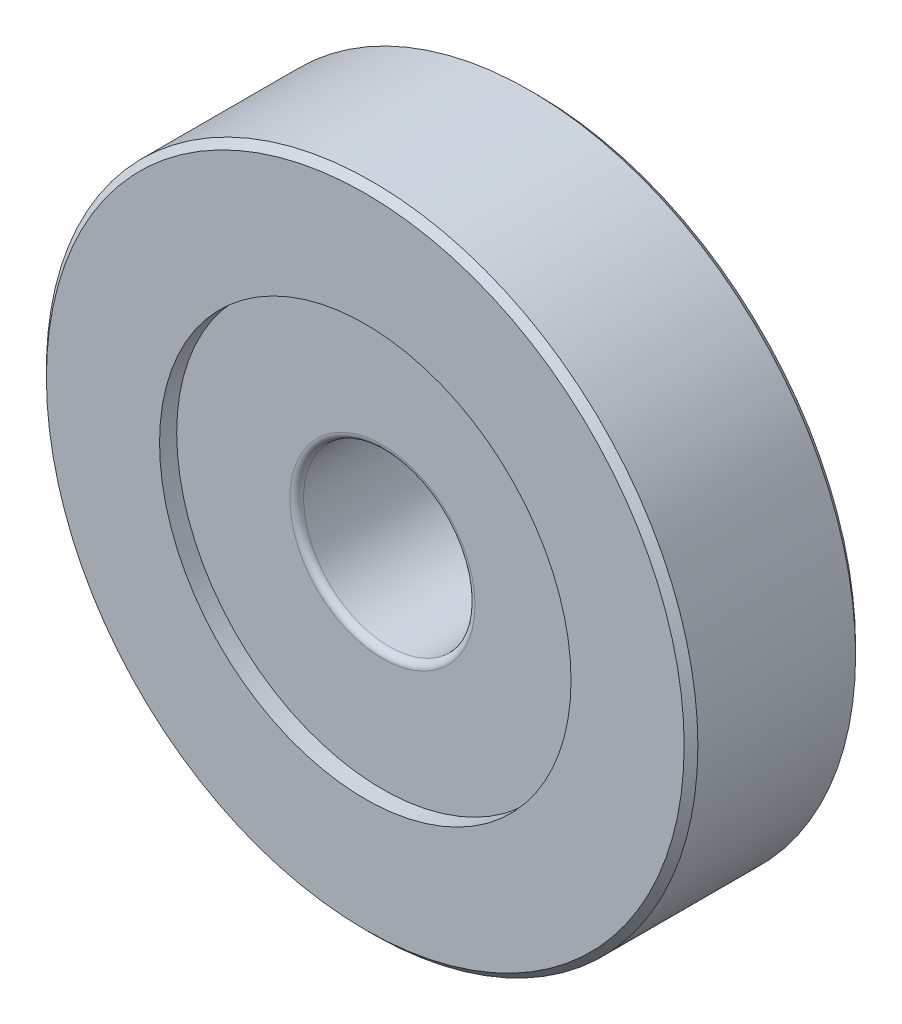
ISO-10303-21;
HEADER;
FILE_DESCRIPTION(('STEP AP214'),'2;1');
FILE_NAME('part.step','',(''),(''),'','','');
FILE_SCHEMA(('AUTOMOTIVE_DESIGN { 1 0 10303 214 1 1 1 1 }'));
ENDSEC;
DATA;
#1=APPLICATION_CONTEXT('core data for automotive mechanical design processes');
#2=APPLICATION_PROTOCOL_DEFINITION('international standard','automotive_design',2000,#1);
#3=PRODUCT_CONTEXT('',#1,'mechanical');
#4=PRODUCT('Part','Part','',(#3));
#5=PRODUCT_RELATED_PRODUCT_CATEGORY('part','',(#4));
#6=PRODUCT_DEFINITION_FORMATION('','',#4);
#7=PRODUCT_DEFINITION_CONTEXT('part definition',#1,'design');
#8=PRODUCT_DEFINITION('design','',#6,#7);
#9=PRODUCT_DEFINITION_SHAPE('','',#8);
#10=(LENGTH_UNIT() NAMED_UNIT(*) SI_UNIT(.MILLI.,.METRE.));
#11=(NAMED_UNIT(*) PLANE_ANGLE_UNIT() SI_UNIT($,.RADIAN.));
#12=(NAMED_UNIT(*) SI_UNIT($,.STERADIAN.) SOLID_ANGLE_UNIT());
#13=UNCERTAINTY_MEASURE_WITH_UNIT(LENGTH_MEASURE(1.E-05),#10,'distance_accuracy_value','');
#14=(GEOMETRIC_REPRESENTATION_CONTEXT(3) GLOBAL_UNCERTAINTY_ASSIGNED_CONTEXT((#13)) GLOBAL_UNIT_ASSIGNED_CONTEXT((#10,
#11,#12)) REPRESENTATION_CONTEXT('',''));
#15=CARTESIAN_POINT('',(0.,0.,0.));
#16=DIRECTION('',(0.,0.,1.));
#17=DIRECTION('',(1.,0.,0.));
#18=AXIS2_PLACEMENT_3D('',#15,#16,#17);
#19=CARTESIAN_POINT('',(0.,0.,1.80000000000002));
#20=DIRECTION('',(0.,0.,1.));
#21=DIRECTION('',(1.,0.,0.));
#22=AXIS2_PLACEMENT_3D('',#19,#20,#21);
#23=TOROIDAL_SURFACE('',#22,2.7,0.199999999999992);
#24=CARTESIAN_POINT('',(0.,0.,1.80000000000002));
#25=DIRECTION('',(0.,0.,1.));
#26=DIRECTION('',(1.,0.,0.));
#27=AXIS2_PLACEMENT_3D('',#24,#25,#26);
#28=CIRCLE('',#27,2.5);
#29=CARTESIAN_POINT('',(2.5,0.,1.80000000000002));
#30=VERTEX_POINT('',#29);
#31=EDGE_CURVE('E8',#30,#30,#28,.T.);
#32=ORIENTED_EDGE('',*,*,#31,.F.);
#33=EDGE_LOOP('',(#32));
#34=FACE_BOUND('',#33,.T.);
#35=CARTESIAN_POINT('',(0.,0.,2.));
#36=DIRECTION('',(0.,0.,1.));
#37=DIRECTION('',(1.,0.,0.));
#38=AXIS2_PLACEMENT_3D('',#35,#36,#37);
#39=CIRCLE('',#38,2.7);
#40=CARTESIAN_POINT('',(2.7,0.,2.));
#41=VERTEX_POINT('',#40);
#42=EDGE_CURVE('E52',#41,#41,#39,.T.);
#43=ORIENTED_EDGE('',*,*,#42,.T.);
#44=EDGE_LOOP('',(#43));
#45=FACE_BOUND('',#44,.T.);
#46=ADVANCED_FACE('F12',(#34,#45),#23,.T.);
#47=CARTESIAN_POINT('',(0.,0.,5.5));
#48=DIRECTION('',(0.,0.,1.));
#49=DIRECTION('',(1.,0.,0.));
#50=AXIS2_PLACEMENT_3D('',#47,#48,#49);
#51=CYLINDRICAL_SURFACE('',#50,2.5);
#52=CARTESIAN_POINT('',(0.,0.,-1.8));
#53=DIRECTION('',(0.,0.,1.));
#54=DIRECTION('',(1.,0.,0.));
#55=AXIS2_PLACEMENT_3D('',#52,#53,#54);
#56=CIRCLE('',#55,2.5);
#57=CARTESIAN_POINT('',(2.5,0.,-1.8));
#58=VERTEX_POINT('',#57);
#59=EDGE_CURVE('E18',#58,#58,#56,.T.);
#60=ORIENTED_EDGE('',*,*,#59,.F.);
#61=EDGE_LOOP('',(#60));
#62=FACE_BOUND('',#61,.T.);
#63=ORIENTED_EDGE('',*,*,#31,.T.);
#64=EDGE_LOOP('',(#63));
#65=FACE_BOUND('',#64,.T.);
#66=ADVANCED_FACE('F113',(#62,#65),#51,.F.);
#67=CARTESIAN_POINT('',(0.,0.,-1.8));
#68=DIRECTION('',(0.,0.,1.));
#69=DIRECTION('',(1.,0.,0.));
#70=AXIS2_PLACEMENT_3D('',#67,#68,#69);
#71=TOROIDAL_SURFACE('',#70,2.7,0.200000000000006);
#72=CARTESIAN_POINT('',(0.,0.,-2.));
#73=DIRECTION('',(0.,0.,1.));
#74=DIRECTION('',(1.,0.,0.));
#75=AXIS2_PLACEMENT_3D('',#72,#73,#74);
#76=CIRCLE('',#75,2.7);
#77=CARTESIAN_POINT('',(2.7,0.,-2.));
#78=VERTEX_POINT('',#77);
#79=EDGE_CURVE('E22',#78,#78,#76,.T.);
#80=ORIENTED_EDGE('',*,*,#79,.F.);
#81=EDGE_LOOP('',(#80));
#82=FACE_BOUND('',#81,.T.);
#83=ORIENTED_EDGE('',*,*,#59,.T.);
#84=EDGE_LOOP('',(#83));
#85=FACE_BOUND('',#84,.T.);
#86=ADVANCED_FACE('F108',(#82,#85),#71,.T.);
#87=CARTESIAN_POINT('',(0.,2.7,-2.));
#88=DIRECTION('',(0.,0.,1.));
#89=DIRECTION('',(1.,0.,0.));
#90=AXIS2_PLACEMENT_3D('',#87,#88,#89);
#91=PLANE('',#90);
#92=CARTESIAN_POINT('',(0.,0.,-2.));
#93=DIRECTION('',(0.,0.,1.));
#94=DIRECTION('',(1.,0.,0.));
#95=AXIS2_PLACEMENT_3D('',#92,#93,#94);
#96=CIRCLE('',#95,6.);
#97=CARTESIAN_POINT('',(6.,0.,-2.));
#98=VERTEX_POINT('',#97);
#99=EDGE_CURVE('E26',#98,#98,#96,.T.);
#100=ORIENTED_EDGE('',*,*,#99,.F.);
#101=EDGE_LOOP('',(#100));
#102=FACE_BOUND('',#101,.T.);
#103=ORIENTED_EDGE('',*,*,#79,.T.);
#104=EDGE_LOOP('',(#103));
#105=FACE_BOUND('',#104,.T.);
#106=ADVANCED_FACE('F102',(#102,#105),#91,.F.);
#107=CARTESIAN_POINT('',(0.,0.,5.5));
#108=DIRECTION('',(0.,0.,1.));
#109=DIRECTION('',(1.,0.,0.));
#110=AXIS2_PLACEMENT_3D('',#107,#108,#109);
#111=CYLINDRICAL_SURFACE('',#110,6.);
#112=CARTESIAN_POINT('',(0.,0.,-2.5));
#113=DIRECTION('',(0.,0.,1.));
#114=DIRECTION('',(1.,0.,0.));
#115=AXIS2_PLACEMENT_3D('',#112,#113,#114);
#116=CIRCLE('',#115,6.);
#117=CARTESIAN_POINT('',(6.,0.,-2.5));
#118=VERTEX_POINT('',#117);
#119=EDGE_CURVE('E31',#118,#118,#116,.T.);
#120=ORIENTED_EDGE('',*,*,#119,.F.);
#121=EDGE_LOOP('',(#120));
#122=FACE_BOUND('',#121,.T.);
#123=ORIENTED_EDGE('',*,*,#99,.T.);
#124=EDGE_LOOP('',(#123));
#125=FACE_BOUND('',#124,.T.);
#126=ADVANCED_FACE('F96',(#122,#125),#111,.F.);
#127=CARTESIAN_POINT('',(0.,9.3,-2.5));
#128=DIRECTION('',(0.,0.,1.));
#129=DIRECTION('',(1.,0.,0.));
#130=AXIS2_PLACEMENT_3D('',#127,#128,#129);
#131=PLANE('',#130);
#132=CARTESIAN_POINT('',(0.,0.,-2.5));
#133=DIRECTION('',(0.,0.,1.));
#134=DIRECTION('',(1.,0.,0.));
#135=AXIS2_PLACEMENT_3D('',#132,#133,#134);
#136=CIRCLE('',#135,9.3);
#137=CARTESIAN_POINT('',(9.3,0.,-2.5));
#138=VERTEX_POINT('',#137);
#139=EDGE_CURVE('E34',#138,#138,#136,.T.);
#140=ORIENTED_EDGE('',*,*,#139,.F.);
#141=EDGE_LOOP('',(#140));
#142=FACE_BOUND('',#141,.T.);
#143=ORIENTED_EDGE('',*,*,#119,.T.);
#144=EDGE_LOOP('',(#143));
#145=FACE_BOUND('',#144,.T.);
#146=ADVANCED_FACE('F90',(#142,#145),#131,.F.);
#147=CARTESIAN_POINT('',(0.,0.,-2.5));
#148=DIRECTION('',(0.,0.,1.));
#149=DIRECTION('',(1.,0.,0.));
#150=AXIS2_PLACEMENT_3D('',#147,#148,#149);
#151=CONICAL_SURFACE('',#150,9.3,0.785398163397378);
#152=CARTESIAN_POINT('',(0.,0.,-2.3));
#153=DIRECTION('',(0.,0.,1.));
#154=DIRECTION('',(1.,0.,0.));
#155=AXIS2_PLACEMENT_3D('',#152,#153,#154);
#156=CIRCLE('',#155,9.5);
#157=CARTESIAN_POINT('',(9.5,0.,-2.3));
#158=VERTEX_POINT('',#157);
#159=EDGE_CURVE('E37',#158,#158,#156,.T.);
#160=ORIENTED_EDGE('',*,*,#159,.F.);
#161=EDGE_LOOP('',(#160));
#162=FACE_BOUND('',#161,.T.);
#163=ORIENTED_EDGE('',*,*,#139,.T.);
#164=EDGE_LOOP('',(#163));
#165=FACE_BOUND('',#164,.T.);
#166=ADVANCED_FACE('F84',(#162,#165),#151,.T.);
#167=CARTESIAN_POINT('',(0.,0.,5.5));
#168=DIRECTION('',(0.,0.,1.));
#169=DIRECTION('',(1.,0.,0.));
#170=AXIS2_PLACEMENT_3D('',#167,#168,#169);
#171=CYLINDRICAL_SURFACE('',#170,9.5);
#172=CARTESIAN_POINT('',(0.,0.,2.30000000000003));
#173=DIRECTION('',(0.,0.,1.));
#174=DIRECTION('',(1.,0.,0.));
#175=AXIS2_PLACEMENT_3D('',#172,#173,#174);
#176=CIRCLE('',#175,9.5);
#177=CARTESIAN_POINT('',(9.5,0.,2.30000000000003));
#178=VERTEX_POINT('',#177);
#179=EDGE_CURVE('E40',#178,#178,#176,.T.);
#180=ORIENTED_EDGE('',*,*,#179,.F.);
#181=EDGE_LOOP('',(#180));
#182=FACE_BOUND('',#181,.T.);
#183=ORIENTED_EDGE('',*,*,#159,.T.);
#184=EDGE_LOOP('',(#183));
#185=FACE_BOUND('',#184,.T.);
#186=ADVANCED_FACE('F78',(#182,#185),#171,.T.);
#187=CARTESIAN_POINT('',(0.,0.,2.30000000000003));
#188=DIRECTION('',(0.,0.,-1.));
#189=DIRECTION('',(-1.,0.,0.));
#190=AXIS2_PLACEMENT_3D('',#187,#188,#189);
#191=CONICAL_SURFACE('',#190,9.5,0.785398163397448);
#192=CARTESIAN_POINT('',(0.,0.,2.5));
#193=DIRECTION('',(0.,0.,1.));
#194=DIRECTION('',(1.,0.,0.));
#195=AXIS2_PLACEMENT_3D('',#192,#193,#194);
#196=CIRCLE('',#195,9.3);
#197=CARTESIAN_POINT('',(9.3,0.,2.5));
#198=VERTEX_POINT('',#197);
#199=EDGE_CURVE('E43',#198,#198,#196,.T.);
#200=ORIENTED_EDGE('',*,*,#199,.F.);
#201=EDGE_LOOP('',(#200));
#202=FACE_BOUND('',#201,.T.);
#203=ORIENTED_EDGE('',*,*,#179,.T.);
#204=EDGE_LOOP('',(#203));
#205=FACE_BOUND('',#204,.T.);
#206=ADVANCED_FACE('F72',(#202,#205),#191,.T.);
#207=CARTESIAN_POINT('',(0.,9.3,2.5));
#208=DIRECTION('',(0.,0.,-1.));
#209=DIRECTION('',(-1.,0.,0.));
#210=AXIS2_PLACEMENT_3D('',#207,#208,#209);
#211=PLANE('',#210);
#212=CARTESIAN_POINT('',(0.,0.,2.5));
#213=DIRECTION('',(0.,0.,1.));
#214=DIRECTION('',(1.,0.,0.));
#215=AXIS2_PLACEMENT_3D('',#212,#213,#214);
#216=CIRCLE('',#215,6.);
#217=CARTESIAN_POINT('',(6.,0.,2.5));
#218=VERTEX_POINT('',#217);
#219=EDGE_CURVE('E46',#218,#218,#216,.T.);
#220=ORIENTED_EDGE('',*,*,#219,.F.);
#221=EDGE_LOOP('',(#220));
#222=FACE_BOUND('',#221,.T.);
#223=ORIENTED_EDGE('',*,*,#199,.T.);
#224=EDGE_LOOP('',(#223));
#225=FACE_BOUND('',#224,.T.);
#226=ADVANCED_FACE('F66',(#222,#225),#211,.F.);
#227=CARTESIAN_POINT('',(0.,0.,5.5));
#228=DIRECTION('',(0.,0.,1.));
#229=DIRECTION('',(1.,0.,0.));
#230=AXIS2_PLACEMENT_3D('',#227,#228,#229);
#231=CYLINDRICAL_SURFACE('',#230,6.);
#232=CARTESIAN_POINT('',(0.,0.,2.));
#233=DIRECTION('',(0.,0.,1.));
#234=DIRECTION('',(1.,0.,0.));
#235=AXIS2_PLACEMENT_3D('',#232,#233,#234);
#236=CIRCLE('',#235,6.);
#237=CARTESIAN_POINT('',(6.,0.,2.));
#238=VERTEX_POINT('',#237);
#239=EDGE_CURVE('E49',#238,#238,#236,.T.);
#240=ORIENTED_EDGE('',*,*,#239,.F.);
#241=EDGE_LOOP('',(#240));
#242=FACE_BOUND('',#241,.T.);
#243=ORIENTED_EDGE('',*,*,#219,.T.);
#244=EDGE_LOOP('',(#243));
#245=FACE_BOUND('',#244,.T.);
#246=ADVANCED_FACE('F60',(#242,#245),#231,.F.);
#247=CARTESIAN_POINT('',(0.,6.,2.));
#248=DIRECTION('',(0.,0.,-1.));
#249=DIRECTION('',(-1.,0.,0.));
#250=AXIS2_PLACEMENT_3D('',#247,#248,#249);
#251=PLANE('',#250);
#252=ORIENTED_EDGE('',*,*,#42,.F.);
#253=EDGE_LOOP('',(#252));
#254=FACE_BOUND('',#253,.T.);
#255=ORIENTED_EDGE('',*,*,#239,.T.);
#256=EDGE_LOOP('',(#255));
#257=FACE_BOUND('',#256,.T.);
#258=ADVANCED_FACE('F57',(#254,#257),#251,.F.);
#259=CLOSED_SHELL('',(#46,#66,#86,#106,#126,#146,#166,#186,#206,#226,#246,#258));
#260=MANIFOLD_SOLID_BREP('B1',#259);
#261=ADVANCED_BREP_SHAPE_REPRESENTATION('',(#18,#260),#14);
#262=SHAPE_DEFINITION_REPRESENTATION(#9,#261);
ENDSEC;
END-ISO-10303-21;
